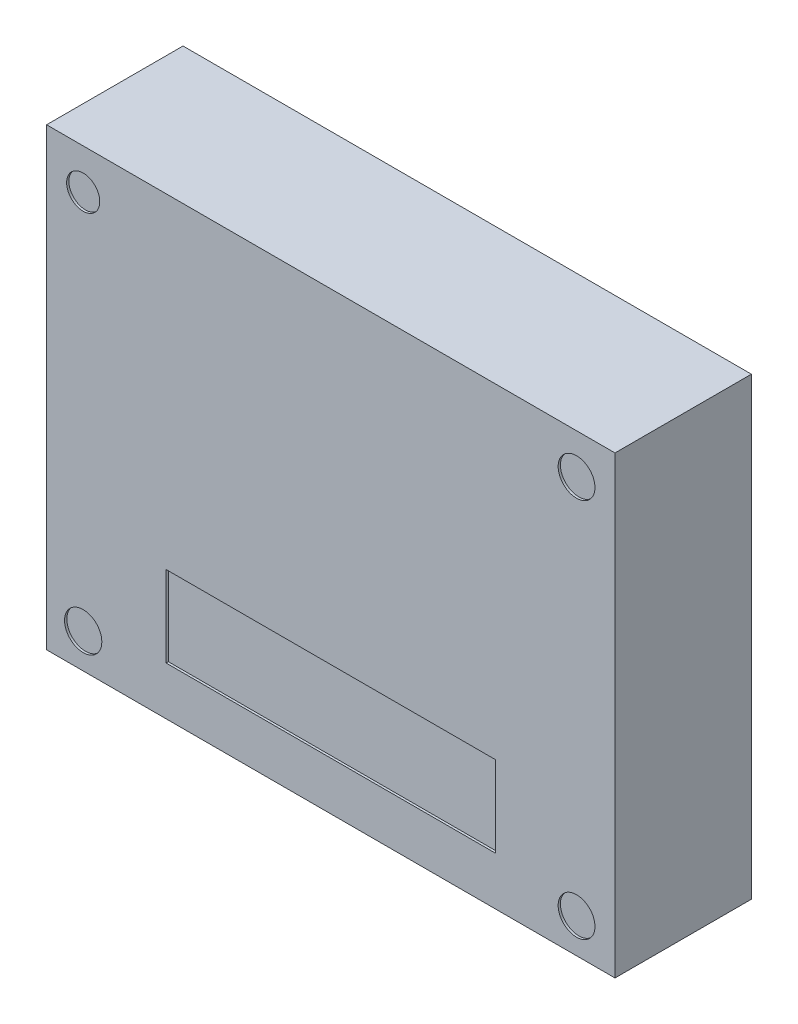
from build123d import *

# Parameters (mm, degrees)
ESQUISSE1_W             = 250
ESQUISSE1_H             = 60
BOSS_EXTRU_1_DEPTH      = 200
ESQUISSE2_W             = 144.936414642
ESQUISSE2_H             = 35.62682818
ENL_V_MAT_EXTRU_1_DEPTH = 1
ESQUISSE3_R             = 7.287305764
ESQUISSE3_R_2           = 8.197594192
ESQUISSE3_R_3           = 8.097006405
ENL_V_MAT_EXTRU_2_DEPTH = 1


with BuildPart() as part:
    # Esquisse1 → Boss.-Extru.1 (new body)
    with BuildSketch(Plane(origin=(0, 0, 0), x_dir=(1, 0, 0), z_dir=(0, 1, 0))):
        Rectangle(ESQUISSE1_W, ESQUISSE1_H)
    extrude(amount=BOSS_EXTRU_1_DEPTH)

    # Esquisse2 → Enl_v. mat.-Extru.1 (cut)
    with BuildSketch(Plane.XY.offset(30)):
        with Locations((0, 39.070026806)):
            Rectangle(ESQUISSE2_W, ESQUISSE2_H)
    extrude(amount=-ENL_V_MAT_EXTRU_1_DEPTH, mode=Mode.SUBTRACT)

    # Esquisse3 → Enl_v. mat.-Extru.2 (cut)
    with BuildSketch(Plane.XY.offset(30)):
        with Locations((-108.904736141, 182.387040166)):
            Circle(ESQUISSE3_R)
        with Locations((-108.904736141, 15.183857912)):
            Circle(ESQUISSE3_R_2)
        with Locations((108.095035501, 15.183857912)):
            Circle(ESQUISSE3_R_3)
        with Locations((108.095035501, 182.387040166)):
            Circle(ESQUISSE3_R_3)
    extrude(amount=-ENL_V_MAT_EXTRU_2_DEPTH, mode=Mode.SUBTRACT)


solid = part.part
